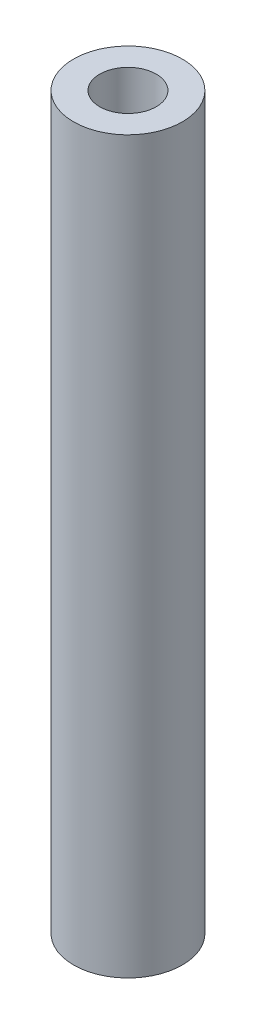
ISO-10303-21;
HEADER;
FILE_DESCRIPTION(('STEP AP214'),'2;1');
FILE_NAME('part.step','',(''),(''),'','','');
FILE_SCHEMA(('AUTOMOTIVE_DESIGN { 1 0 10303 214 1 1 1 1 }'));
ENDSEC;
DATA;
#1=APPLICATION_CONTEXT('core data for automotive mechanical design processes');
#2=APPLICATION_PROTOCOL_DEFINITION('international standard','automotive_design',2000,#1);
#3=PRODUCT_CONTEXT('',#1,'mechanical');
#4=PRODUCT('Part','Part','',(#3));
#5=PRODUCT_RELATED_PRODUCT_CATEGORY('part','',(#4));
#6=PRODUCT_DEFINITION_FORMATION('','',#4);
#7=PRODUCT_DEFINITION_CONTEXT('part definition',#1,'design');
#8=PRODUCT_DEFINITION('design','',#6,#7);
#9=PRODUCT_DEFINITION_SHAPE('','',#8);
#10=(LENGTH_UNIT() NAMED_UNIT(*) SI_UNIT(.MILLI.,.METRE.));
#11=(NAMED_UNIT(*) PLANE_ANGLE_UNIT() SI_UNIT($,.RADIAN.));
#12=(NAMED_UNIT(*) SI_UNIT($,.STERADIAN.) SOLID_ANGLE_UNIT());
#13=UNCERTAINTY_MEASURE_WITH_UNIT(LENGTH_MEASURE(1.E-05),#10,'distance_accuracy_value','');
#14=(GEOMETRIC_REPRESENTATION_CONTEXT(3) GLOBAL_UNCERTAINTY_ASSIGNED_CONTEXT((#13)) GLOBAL_UNIT_ASSIGNED_CONTEXT((#10,
#11,#12)) REPRESENTATION_CONTEXT('',''));
#15=CARTESIAN_POINT('',(0.,0.,0.));
#16=DIRECTION('',(0.,0.,1.));
#17=DIRECTION('',(1.,0.,0.));
#18=AXIS2_PLACEMENT_3D('',#15,#16,#17);
#19=CARTESIAN_POINT('',(0.,85.217,0.));
#20=DIRECTION('',(0.,1.,0.));
#21=DIRECTION('',(0.,0.,1.));
#22=AXIS2_PLACEMENT_3D('',#19,#20,#21);
#23=PLANE('',#22);
#24=CARTESIAN_POINT('',(0.,85.217,0.));
#25=DIRECTION('',(0.,1.,0.));
#26=DIRECTION('',(0.,0.,1.));
#27=AXIS2_PLACEMENT_3D('',#24,#25,#26);
#28=CIRCLE('',#27,6.35);
#29=CARTESIAN_POINT('',(0.,85.217,6.35));
#30=VERTEX_POINT('',#29);
#31=EDGE_CURVE('E10',#30,#30,#28,.T.);
#32=ORIENTED_EDGE('',*,*,#31,.T.);
#33=EDGE_LOOP('',(#32));
#34=FACE_BOUND('',#33,.T.);
#35=CARTESIAN_POINT('',(0.,85.217,0.));
#36=DIRECTION('',(0.,1.,0.));
#37=DIRECTION('',(0.,0.,1.));
#38=AXIS2_PLACEMENT_3D('',#35,#36,#37);
#39=CIRCLE('',#38,3.302);
#40=CARTESIAN_POINT('',(0.,85.217,3.302));
#41=VERTEX_POINT('',#40);
#42=EDGE_CURVE('E41',#41,#41,#39,.T.);
#43=ORIENTED_EDGE('',*,*,#42,.F.);
#44=EDGE_LOOP('',(#43));
#45=FACE_BOUND('',#44,.T.);
#46=ADVANCED_FACE('F30',(#34,#45),#23,.T.);
#47=CARTESIAN_POINT('',(0.,0.,0.));
#48=DIRECTION('',(0.,1.,0.));
#49=DIRECTION('',(0.,0.,1.));
#50=AXIS2_PLACEMENT_3D('',#47,#48,#49);
#51=PLANE('',#50);
#52=CARTESIAN_POINT('',(0.,0.,0.));
#53=DIRECTION('',(0.,1.,0.));
#54=DIRECTION('',(0.,0.,1.));
#55=AXIS2_PLACEMENT_3D('',#52,#53,#54);
#56=CIRCLE('',#55,6.35);
#57=CARTESIAN_POINT('',(0.,0.,6.35));
#58=VERTEX_POINT('',#57);
#59=EDGE_CURVE('E34',#58,#58,#56,.T.);
#60=ORIENTED_EDGE('',*,*,#59,.F.);
#61=EDGE_LOOP('',(#60));
#62=FACE_BOUND('',#61,.T.);
#63=CARTESIAN_POINT('',(0.,0.,0.));
#64=DIRECTION('',(0.,1.,0.));
#65=DIRECTION('',(0.,0.,1.));
#66=AXIS2_PLACEMENT_3D('',#63,#64,#65);
#67=CIRCLE('',#66,3.302);
#68=CARTESIAN_POINT('',(0.,0.,3.302));
#69=VERTEX_POINT('',#68);
#70=EDGE_CURVE('E43',#69,#69,#67,.T.);
#71=ORIENTED_EDGE('',*,*,#70,.T.);
#72=EDGE_LOOP('',(#71));
#73=FACE_BOUND('',#72,.T.);
#74=ADVANCED_FACE('F53',(#62,#73),#51,.F.);
#75=CARTESIAN_POINT('',(0.,85.217,0.));
#76=DIRECTION('',(0.,-1.,0.));
#77=DIRECTION('',(0.,0.,-1.));
#78=AXIS2_PLACEMENT_3D('',#75,#76,#77);
#79=CYLINDRICAL_SURFACE('',#78,6.35);
#80=ORIENTED_EDGE('',*,*,#31,.F.);
#81=EDGE_LOOP('',(#80));
#82=FACE_BOUND('',#81,.T.);
#83=ORIENTED_EDGE('',*,*,#59,.T.);
#84=EDGE_LOOP('',(#83));
#85=FACE_BOUND('',#84,.T.);
#86=ADVANCED_FACE('F32',(#82,#85),#79,.T.);
#87=CARTESIAN_POINT('',(0.,85.217,0.));
#88=DIRECTION('',(0.,-1.,0.));
#89=DIRECTION('',(0.,0.,-1.));
#90=AXIS2_PLACEMENT_3D('',#87,#88,#89);
#91=CYLINDRICAL_SURFACE('',#90,3.302);
#92=ORIENTED_EDGE('',*,*,#42,.T.);
#93=EDGE_LOOP('',(#92));
#94=FACE_BOUND('',#93,.T.);
#95=ORIENTED_EDGE('',*,*,#70,.F.);
#96=EDGE_LOOP('',(#95));
#97=FACE_BOUND('',#96,.T.);
#98=ADVANCED_FACE('F49',(#94,#97),#91,.F.);
#99=CLOSED_SHELL('',(#46,#74,#86,#98));
#100=MANIFOLD_SOLID_BREP('B2',#99);
#101=ADVANCED_BREP_SHAPE_REPRESENTATION('',(#18,#100),#14);
#102=SHAPE_DEFINITION_REPRESENTATION(#9,#101);
ENDSEC;
END-ISO-10303-21;
